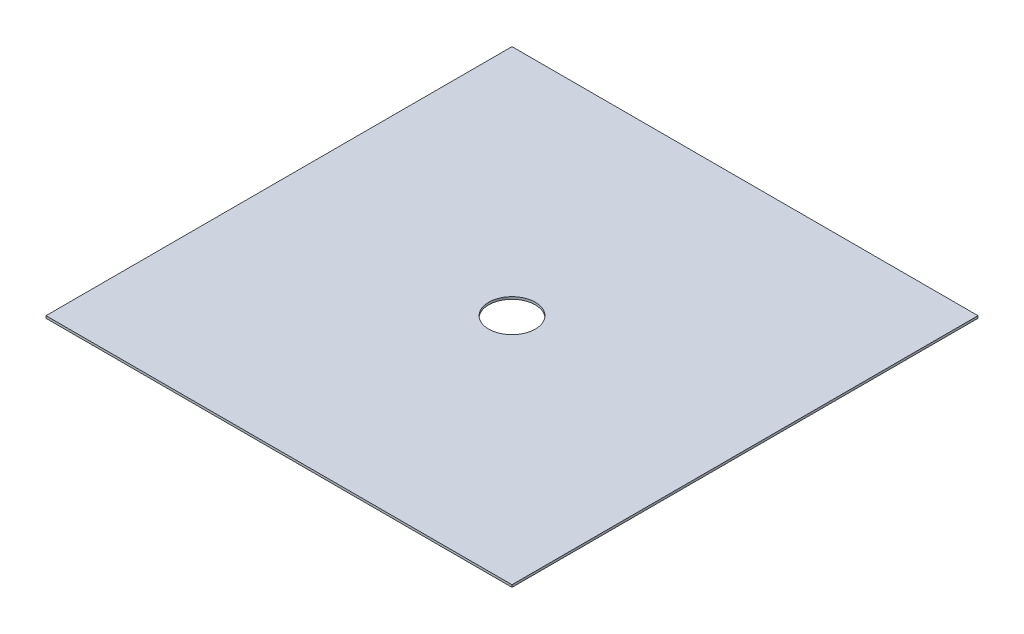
ISO-10303-21;
HEADER;
FILE_DESCRIPTION(('STEP AP214'),'2;1');
FILE_NAME('part.step','',(''),(''),'','','');
FILE_SCHEMA(('AUTOMOTIVE_DESIGN { 1 0 10303 214 1 1 1 1 }'));
ENDSEC;
DATA;
#1=APPLICATION_CONTEXT('core data for automotive mechanical design processes');
#2=APPLICATION_PROTOCOL_DEFINITION('international standard','automotive_design',2000,#1);
#3=PRODUCT_CONTEXT('',#1,'mechanical');
#4=PRODUCT('Part','Part','',(#3));
#5=PRODUCT_RELATED_PRODUCT_CATEGORY('part','',(#4));
#6=PRODUCT_DEFINITION_FORMATION('','',#4);
#7=PRODUCT_DEFINITION_CONTEXT('part definition',#1,'design');
#8=PRODUCT_DEFINITION('design','',#6,#7);
#9=PRODUCT_DEFINITION_SHAPE('','',#8);
#10=(LENGTH_UNIT() NAMED_UNIT(*) SI_UNIT(.MILLI.,.METRE.));
#11=(NAMED_UNIT(*) PLANE_ANGLE_UNIT() SI_UNIT($,.RADIAN.));
#12=(NAMED_UNIT(*) SI_UNIT($,.STERADIAN.) SOLID_ANGLE_UNIT());
#13=UNCERTAINTY_MEASURE_WITH_UNIT(LENGTH_MEASURE(1.E-05),#10,'distance_accuracy_value','');
#14=(GEOMETRIC_REPRESENTATION_CONTEXT(3) GLOBAL_UNCERTAINTY_ASSIGNED_CONTEXT((#13)) GLOBAL_UNIT_ASSIGNED_CONTEXT((#10,
#11,#12)) REPRESENTATION_CONTEXT('',''));
#15=CARTESIAN_POINT('',(0.,0.,0.));
#16=DIRECTION('',(0.,0.,1.));
#17=DIRECTION('',(1.,0.,0.));
#18=AXIS2_PLACEMENT_3D('',#15,#16,#17);
#19=CARTESIAN_POINT('',(0.,2.54,-25.4));
#20=DIRECTION('',(0.,0.,1.));
#21=DIRECTION('',(1.,0.,0.));
#22=AXIS2_PLACEMENT_3D('',#19,#20,#21);
#23=PLANE('',#22);
#24=DIRECTION('',(0.,1.,0.));
#25=VECTOR('',#24,1.);
#26=CARTESIAN_POINT('',(139.7,2.54,-25.4));
#27=LINE('',#26,#25);
#28=CARTESIAN_POINT('',(139.7,2.413,-25.4));
#29=VERTEX_POINT('',#28);
#30=CARTESIAN_POINT('',(139.7,2.667,-25.4));
#31=VERTEX_POINT('',#30);
#32=EDGE_CURVE('E11',#29,#31,#27,.T.);
#33=ORIENTED_EDGE('',*,*,#32,.F.);
#34=DIRECTION('',(1.,0.,0.));
#35=VECTOR('',#34,1.);
#36=CARTESIAN_POINT('',(0.,2.413,-25.4));
#37=LINE('',#36,#35);
#38=CARTESIAN_POINT('',(88.9,2.413,-25.4));
#39=VERTEX_POINT('',#38);
#40=EDGE_CURVE('E94',#29,#39,#37,.F.);
#41=ORIENTED_EDGE('',*,*,#40,.T.);
#42=DIRECTION('',(0.,1.,0.));
#43=VECTOR('',#42,1.);
#44=CARTESIAN_POINT('',(88.9,2.54,-25.4));
#45=LINE('',#44,#43);
#46=CARTESIAN_POINT('',(88.9,2.667,-25.4));
#47=VERTEX_POINT('',#46);
#48=EDGE_CURVE('E49',#39,#47,#45,.T.);
#49=ORIENTED_EDGE('',*,*,#48,.T.);
#50=DIRECTION('',(1.,0.,0.));
#51=VECTOR('',#50,1.);
#52=CARTESIAN_POINT('',(0.,2.667,-25.4));
#53=LINE('',#52,#51);
#54=EDGE_CURVE('E111',#31,#47,#53,.F.);
#55=ORIENTED_EDGE('',*,*,#54,.F.);
#56=EDGE_LOOP('',(#33,#41,#49,#55));
#57=FACE_BOUND('',#56,.T.);
#58=ADVANCED_FACE('F39',(#57),#23,.F.);
#59=CARTESIAN_POINT('',(88.9,2.54,0.));
#60=DIRECTION('',(-1.,0.,0.));
#61=DIRECTION('',(0.,0.,1.));
#62=AXIS2_PLACEMENT_3D('',#59,#60,#61);
#63=PLANE('',#62);
#64=ORIENTED_EDGE('',*,*,#48,.F.);
#65=DIRECTION('',(0.,0.,1.));
#66=VECTOR('',#65,1.);
#67=CARTESIAN_POINT('',(88.9,2.413,0.));
#68=LINE('',#67,#66);
#69=CARTESIAN_POINT('',(88.9,2.413,25.4));
#70=VERTEX_POINT('',#69);
#71=EDGE_CURVE('E105',#70,#39,#68,.F.);
#72=ORIENTED_EDGE('',*,*,#71,.F.);
#73=DIRECTION('',(0.,1.,0.));
#74=VECTOR('',#73,1.);
#75=CARTESIAN_POINT('',(88.9,2.54,25.4));
#76=LINE('',#75,#74);
#77=CARTESIAN_POINT('',(88.9,2.667,25.4));
#78=VERTEX_POINT('',#77);
#79=EDGE_CURVE('E57',#70,#78,#76,.T.);
#80=ORIENTED_EDGE('',*,*,#79,.T.);
#81=DIRECTION('',(0.,0.,1.));
#82=VECTOR('',#81,1.);
#83=CARTESIAN_POINT('',(88.9,2.667,0.));
#84=LINE('',#83,#82);
#85=EDGE_CURVE('E88',#78,#47,#84,.F.);
#86=ORIENTED_EDGE('',*,*,#85,.T.);
#87=EDGE_LOOP('',(#64,#72,#80,#86));
#88=FACE_BOUND('',#87,.T.);
#89=ADVANCED_FACE('F115',(#88),#63,.T.);
#90=CARTESIAN_POINT('',(0.,2.54,25.4));
#91=DIRECTION('',(0.,0.,1.));
#92=DIRECTION('',(1.,0.,0.));
#93=AXIS2_PLACEMENT_3D('',#90,#91,#92);
#94=PLANE('',#93);
#95=ORIENTED_EDGE('',*,*,#79,.F.);
#96=DIRECTION('',(1.,0.,0.));
#97=VECTOR('',#96,1.);
#98=CARTESIAN_POINT('',(0.,2.413,25.4));
#99=LINE('',#98,#97);
#100=CARTESIAN_POINT('',(139.7,2.413,25.4));
#101=VERTEX_POINT('',#100);
#102=EDGE_CURVE('E93',#70,#101,#99,.T.);
#103=ORIENTED_EDGE('',*,*,#102,.T.);
#104=DIRECTION('',(0.,1.,0.));
#105=VECTOR('',#104,1.);
#106=CARTESIAN_POINT('',(139.7,2.54,25.4));
#107=LINE('',#106,#105);
#108=CARTESIAN_POINT('',(139.7,2.667,25.4));
#109=VERTEX_POINT('',#108);
#110=EDGE_CURVE('E43',#101,#109,#107,.T.);
#111=ORIENTED_EDGE('',*,*,#110,.T.);
#112=DIRECTION('',(1.,0.,0.));
#113=VECTOR('',#112,1.);
#114=CARTESIAN_POINT('',(0.,2.667,25.4));
#115=LINE('',#114,#113);
#116=EDGE_CURVE('E107',#78,#109,#115,.T.);
#117=ORIENTED_EDGE('',*,*,#116,.F.);
#118=EDGE_LOOP('',(#95,#103,#111,#117));
#119=FACE_BOUND('',#118,.T.);
#120=ADVANCED_FACE('F96',(#119),#94,.T.);
#121=CARTESIAN_POINT('',(139.7,2.54,0.));
#122=DIRECTION('',(-1.,0.,0.));
#123=DIRECTION('',(0.,0.,1.));
#124=AXIS2_PLACEMENT_3D('',#121,#122,#123);
#125=PLANE('',#124);
#126=DIRECTION('',(0.,0.,1.));
#127=VECTOR('',#126,1.);
#128=CARTESIAN_POINT('',(139.7,2.413,0.));
#129=LINE('',#128,#127);
#130=EDGE_CURVE('E82',#101,#29,#129,.F.);
#131=ORIENTED_EDGE('',*,*,#130,.T.);
#132=ORIENTED_EDGE('',*,*,#32,.T.);
#133=DIRECTION('',(0.,0.,1.));
#134=VECTOR('',#133,1.);
#135=CARTESIAN_POINT('',(139.7,2.667,0.));
#136=LINE('',#135,#134);
#137=EDGE_CURVE('E84',#109,#31,#136,.F.);
#138=ORIENTED_EDGE('',*,*,#137,.F.);
#139=ORIENTED_EDGE('',*,*,#110,.F.);
#140=EDGE_LOOP('',(#131,#132,#138,#139));
#141=FACE_BOUND('',#140,.T.);
#142=ADVANCED_FACE('F41',(#141),#125,.F.);
#143=CARTESIAN_POINT('',(0.,2.667,0.));
#144=DIRECTION('',(0.,1.,0.));
#145=DIRECTION('',(0.,0.,1.));
#146=AXIS2_PLACEMENT_3D('',#143,#144,#145);
#147=PLANE('',#146);
#148=CARTESIAN_POINT('',(114.3,2.667,0.));
#149=DIRECTION('',(0.,1.,0.));
#150=DIRECTION('',(0.,0.,1.));
#151=AXIS2_PLACEMENT_3D('',#148,#149,#150);
#152=CIRCLE('',#151,2.54);
#153=CARTESIAN_POINT('',(114.3,2.667,2.53999999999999));
#154=VERTEX_POINT('',#153);
#155=EDGE_CURVE('E100',#154,#154,#152,.T.);
#156=ORIENTED_EDGE('',*,*,#155,.F.);
#157=EDGE_LOOP('',(#156));
#158=FACE_BOUND('',#157,.T.);
#159=ORIENTED_EDGE('',*,*,#116,.T.);
#160=ORIENTED_EDGE('',*,*,#137,.T.);
#161=ORIENTED_EDGE('',*,*,#54,.T.);
#162=ORIENTED_EDGE('',*,*,#85,.F.);
#163=EDGE_LOOP('',(#159,#160,#161,#162));
#164=FACE_BOUND('',#163,.T.);
#165=ADVANCED_FACE('F114',(#158,#164),#147,.T.);
#166=CARTESIAN_POINT('',(0.,2.413,0.));
#167=DIRECTION('',(0.,1.,0.));
#168=DIRECTION('',(0.,0.,1.));
#169=AXIS2_PLACEMENT_3D('',#166,#167,#168);
#170=PLANE('',#169);
#171=CARTESIAN_POINT('',(114.3,2.413,0.));
#172=DIRECTION('',(0.,1.,0.));
#173=DIRECTION('',(0.,0.,1.));
#174=AXIS2_PLACEMENT_3D('',#171,#172,#173);
#175=CIRCLE('',#174,2.54);
#176=CARTESIAN_POINT('',(114.3,2.413,2.53999999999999));
#177=VERTEX_POINT('',#176);
#178=EDGE_CURVE('E97',#177,#177,#175,.T.);
#179=ORIENTED_EDGE('',*,*,#178,.T.);
#180=EDGE_LOOP('',(#179));
#181=FACE_BOUND('',#180,.T.);
#182=ORIENTED_EDGE('',*,*,#102,.F.);
#183=ORIENTED_EDGE('',*,*,#71,.T.);
#184=ORIENTED_EDGE('',*,*,#40,.F.);
#185=ORIENTED_EDGE('',*,*,#130,.F.);
#186=EDGE_LOOP('',(#182,#183,#184,#185));
#187=FACE_BOUND('',#186,.T.);
#188=ADVANCED_FACE('F91',(#181,#187),#170,.F.);
#189=CARTESIAN_POINT('',(114.3,2.413,0.));
#190=DIRECTION('',(0.,1.,0.));
#191=DIRECTION('',(0.,0.,1.));
#192=AXIS2_PLACEMENT_3D('',#189,#190,#191);
#193=CYLINDRICAL_SURFACE('',#192,2.54);
#194=ORIENTED_EDGE('',*,*,#178,.F.);
#195=EDGE_LOOP('',(#194));
#196=FACE_BOUND('',#195,.T.);
#197=ORIENTED_EDGE('',*,*,#155,.T.);
#198=EDGE_LOOP('',(#197));
#199=FACE_BOUND('',#198,.T.);
#200=ADVANCED_FACE('F122',(#196,#199),#193,.F.);
#201=CLOSED_SHELL('',(#58,#89,#120,#142,#165,#188,#200));
#202=MANIFOLD_SOLID_BREP('B2',#201);
#203=ADVANCED_BREP_SHAPE_REPRESENTATION('',(#18,#202),#14);
#204=SHAPE_DEFINITION_REPRESENTATION(#9,#203);
ENDSEC;
END-ISO-10303-21;
